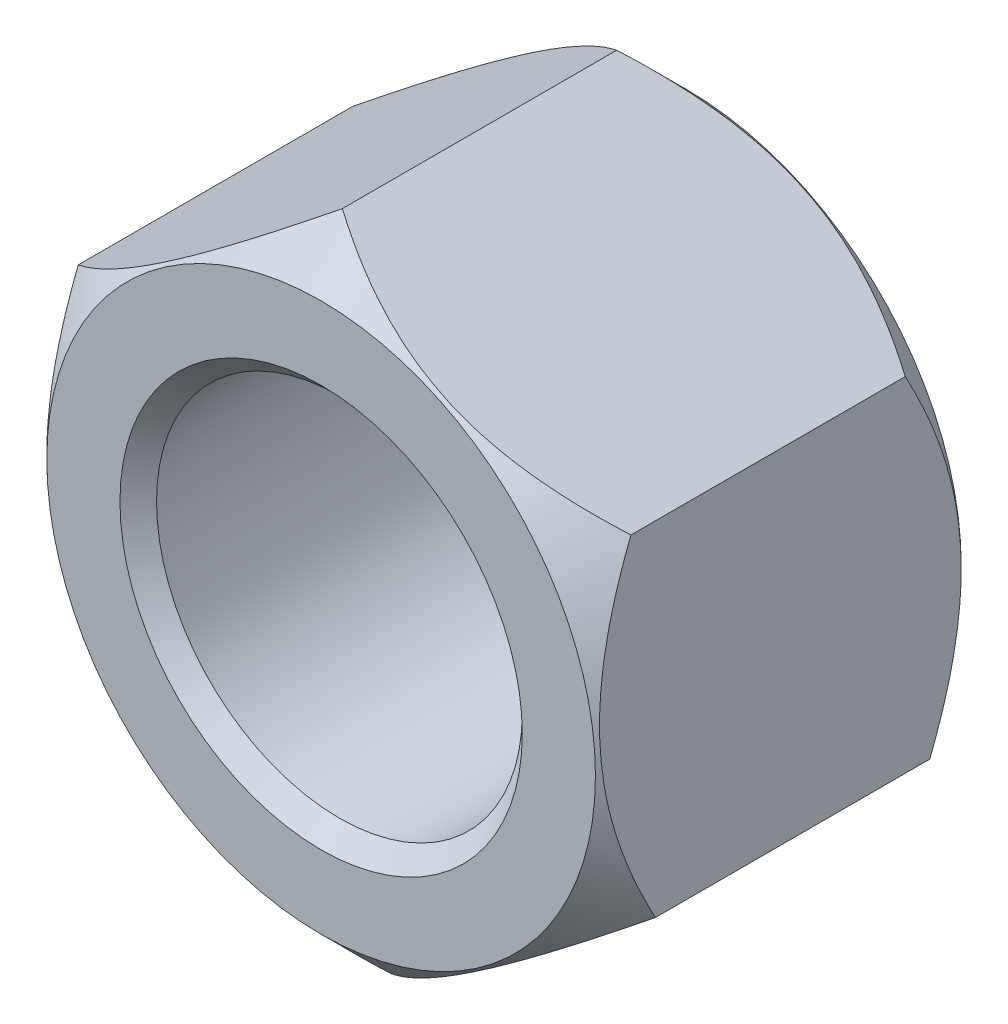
ISO-10303-21;
HEADER;
FILE_DESCRIPTION(('STEP AP214'),'2;1');
FILE_NAME('part.step','',(''),(''),'','','');
FILE_SCHEMA(('AUTOMOTIVE_DESIGN { 1 0 10303 214 1 1 1 1 }'));
ENDSEC;
DATA;
#1=APPLICATION_CONTEXT('core data for automotive mechanical design processes');
#2=APPLICATION_PROTOCOL_DEFINITION('international standard','automotive_design',2000,#1);
#3=PRODUCT_CONTEXT('',#1,'mechanical');
#4=PRODUCT('Part','Part','',(#3));
#5=PRODUCT_RELATED_PRODUCT_CATEGORY('part','',(#4));
#6=PRODUCT_DEFINITION_FORMATION('','',#4);
#7=PRODUCT_DEFINITION_CONTEXT('part definition',#1,'design');
#8=PRODUCT_DEFINITION('design','',#6,#7);
#9=PRODUCT_DEFINITION_SHAPE('','',#8);
#10=(LENGTH_UNIT() NAMED_UNIT(*) SI_UNIT(.MILLI.,.METRE.));
#11=(NAMED_UNIT(*) PLANE_ANGLE_UNIT() SI_UNIT($,.RADIAN.));
#12=(NAMED_UNIT(*) SI_UNIT($,.STERADIAN.) SOLID_ANGLE_UNIT());
#13=UNCERTAINTY_MEASURE_WITH_UNIT(LENGTH_MEASURE(1.E-05),#10,'distance_accuracy_value','');
#14=(GEOMETRIC_REPRESENTATION_CONTEXT(3) GLOBAL_UNCERTAINTY_ASSIGNED_CONTEXT((#13)) GLOBAL_UNIT_ASSIGNED_CONTEXT((#10,
#11,#12)) REPRESENTATION_CONTEXT('',''));
#15=CARTESIAN_POINT('',(0.,0.,0.));
#16=DIRECTION('',(0.,0.,1.));
#17=DIRECTION('',(1.,0.,0.));
#18=AXIS2_PLACEMENT_3D('',#15,#16,#17);
#19=CARTESIAN_POINT('',(0.,0.,4.));
#20=DIRECTION('',(0.,0.,1.));
#21=DIRECTION('',(1.,0.,0.));
#22=AXIS2_PLACEMENT_3D('',#19,#20,#21);
#23=PLANE('',#22);
#24=CARTESIAN_POINT('',(0.,0.,4.));
#25=DIRECTION('',(0.,0.,1.));
#26=DIRECTION('',(1.,0.,0.));
#27=AXIS2_PLACEMENT_3D('',#24,#25,#26);
#28=CIRCLE('',#27,2.2);
#29=CARTESIAN_POINT('',(2.2,0.,4.));
#30=VERTEX_POINT('',#29);
#31=EDGE_CURVE('E11',#30,#30,#28,.F.);
#32=ORIENTED_EDGE('',*,*,#31,.T.);
#33=EDGE_LOOP('',(#32));
#34=FACE_BOUND('',#33,.T.);
#35=CARTESIAN_POINT('',(0.,0.,4.));
#36=DIRECTION('',(0.,0.,1.));
#37=DIRECTION('',(1.,0.,0.));
#38=AXIS2_PLACEMENT_3D('',#35,#36,#37);
#39=CIRCLE('',#38,3.);
#40=CARTESIAN_POINT('',(3.,0.,4.));
#41=VERTEX_POINT('',#40);
#42=EDGE_CURVE('E115',#41,#41,#39,.T.);
#43=ORIENTED_EDGE('',*,*,#42,.T.);
#44=EDGE_LOOP('',(#43));
#45=FACE_BOUND('',#44,.T.);
#46=ADVANCED_FACE('F35',(#34,#45),#23,.T.);
#47=CARTESIAN_POINT('',(0.,0.,0.));
#48=DIRECTION('',(0.,0.,1.));
#49=DIRECTION('',(1.,0.,0.));
#50=AXIS2_PLACEMENT_3D('',#47,#48,#49);
#51=PLANE('',#50);
#52=CARTESIAN_POINT('',(0.,0.,0.));
#53=DIRECTION('',(0.,0.,1.));
#54=DIRECTION('',(1.,0.,0.));
#55=AXIS2_PLACEMENT_3D('',#52,#53,#54);
#56=CIRCLE('',#55,2.2);
#57=CARTESIAN_POINT('',(-2.2,0.,0.));
#58=VERTEX_POINT('',#57);
#59=EDGE_CURVE('E143',#58,#58,#56,.T.);
#60=ORIENTED_EDGE('',*,*,#59,.T.);
#61=EDGE_LOOP('',(#60));
#62=FACE_BOUND('',#61,.T.);
#63=CARTESIAN_POINT('',(0.,0.,0.));
#64=DIRECTION('',(0.,0.,1.));
#65=DIRECTION('',(1.,0.,0.));
#66=AXIS2_PLACEMENT_3D('',#63,#64,#65);
#67=CIRCLE('',#66,3.);
#68=CARTESIAN_POINT('',(3.,0.,0.));
#69=VERTEX_POINT('',#68);
#70=EDGE_CURVE('E112',#69,#69,#67,.F.);
#71=ORIENTED_EDGE('',*,*,#70,.T.);
#72=EDGE_LOOP('',(#71));
#73=FACE_BOUND('',#72,.T.);
#74=ADVANCED_FACE('F236',(#62,#73),#51,.F.);
#75=CARTESIAN_POINT('',(0.,0.,4.));
#76=DIRECTION('',(0.,0.,-1.));
#77=DIRECTION('',(-1.,0.,0.));
#78=AXIS2_PLACEMENT_3D('',#75,#76,#77);
#79=CYLINDRICAL_SURFACE('',#78,2.);
#80=CARTESIAN_POINT('',(0.,0.,0.2));
#81=DIRECTION('',(0.,0.,1.));
#82=DIRECTION('',(1.,0.,0.));
#83=AXIS2_PLACEMENT_3D('',#80,#81,#82);
#84=CIRCLE('',#83,2.);
#85=CARTESIAN_POINT('',(-2.,0.,0.2));
#86=VERTEX_POINT('',#85);
#87=EDGE_CURVE('E43',#86,#86,#84,.F.);
#88=ORIENTED_EDGE('',*,*,#87,.T.);
#89=EDGE_LOOP('',(#88));
#90=FACE_BOUND('',#89,.T.);
#91=CARTESIAN_POINT('',(0.,0.,3.8));
#92=DIRECTION('',(0.,0.,1.));
#93=DIRECTION('',(1.,0.,0.));
#94=AXIS2_PLACEMENT_3D('',#91,#92,#93);
#95=CIRCLE('',#94,2.);
#96=CARTESIAN_POINT('',(2.,0.,3.8));
#97=VERTEX_POINT('',#96);
#98=EDGE_CURVE('E248',#97,#97,#95,.T.);
#99=ORIENTED_EDGE('',*,*,#98,.T.);
#100=EDGE_LOOP('',(#99));
#101=FACE_BOUND('',#100,.T.);
#102=ADVANCED_FACE('F135',(#90,#101),#79,.F.);
#103=CARTESIAN_POINT('',(0.,0.,0.499999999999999));
#104=DIRECTION('',(0.,0.,1.));
#105=DIRECTION('',(1.,0.,0.));
#106=AXIS2_PLACEMENT_3D('',#103,#104,#105);
#107=CONICAL_SURFACE('',#106,3.5,0.78539816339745);
#108=CARTESIAN_POINT('',(2.88854722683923,1.97663128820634,0.500110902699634));
#109=CARTESIAN_POINT('',(2.78005952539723,2.02864024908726,0.440007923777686));
#110=CARTESIAN_POINT('',(2.66975777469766,2.08151886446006,0.383434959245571));
#111=CARTESIAN_POINT('',(2.44484047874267,2.18934412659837,0.279851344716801));
#112=CARTESIAN_POINT('',(2.33020354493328,2.24430102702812,0.232898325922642));
#113=CARTESIAN_POINT('',(2.09904368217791,2.35511897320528,0.152466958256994));
#114=CARTESIAN_POINT('',(1.98257961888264,2.41095179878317,0.118786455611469));
#115=CARTESIAN_POINT('',(1.74708757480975,2.52384659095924,0.0668947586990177));
#116=CARTESIAN_POINT('',(1.62806678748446,2.58090510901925,0.0486448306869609));
#117=CARTESIAN_POINT('',(1.42293919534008,2.67924319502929,0.0321785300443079));
#118=CARTESIAN_POINT('',(1.33709729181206,2.72039576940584,0.0297410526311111));
#119=CARTESIAN_POINT('',(1.16555311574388,2.80263397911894,0.0338483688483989));
#120=CARTESIAN_POINT('',(1.07985090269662,2.84371958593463,0.040396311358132));
#121=CARTESIAN_POINT('',(0.909258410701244,2.92550155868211,0.0621005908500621));
#122=CARTESIAN_POINT('',(0.824369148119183,2.96619743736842,0.077266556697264));
#123=CARTESIAN_POINT('',(0.656048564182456,3.04689025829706,0.115379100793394));
#124=CARTESIAN_POINT('',(0.572617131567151,3.08688725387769,0.138325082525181));
#125=CARTESIAN_POINT('',(0.424502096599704,3.15789354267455,0.185535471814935));
#126=CARTESIAN_POINT('',(0.359490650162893,3.18906000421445,0.208558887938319));
#127=CARTESIAN_POINT('',(0.230634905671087,3.25083339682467,0.25831633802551));
#128=CARTESIAN_POINT('',(0.166790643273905,3.28144031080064,0.285050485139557));
#129=CARTESIAN_POINT('',(0.0404704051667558,3.34199818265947,0.341630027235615));
#130=CARTESIAN_POINT('',(-0.0220091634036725,3.3719508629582,0.371465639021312));
#131=CARTESIAN_POINT('',(-0.145811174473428,3.43130149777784,0.433856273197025));
#132=CARTESIAN_POINT('',(-0.207134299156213,3.46069977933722,0.46640962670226));
#133=CARTESIAN_POINT('',(-0.267922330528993,3.48984153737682,0.500110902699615));
#134=B_SPLINE_CURVE_WITH_KNOTS('',3,(#108,#109,#110,#111,#112,#113,#114,#115,#116,#117,#118,
#119,#120,#121,#122,#123,#124,#125,#126,#127,#128,#129,#130,#131,#132,#133),.UNSPECIFIED.,.F.,
.F.,(4,2,2,2,2,2,2,2,2,2,2,2,4),(0.,0.403741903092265,0.809836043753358,1.20948085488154,
1.60811947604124,1.8933986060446,2.17877773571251,2.46447634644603,2.75015305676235,
2.97709555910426,3.20404498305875,3.43029907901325,3.65641524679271),.UNSPECIFIED.);
#135=CARTESIAN_POINT('',(2.88834722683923,1.97672716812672,0.500000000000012));
#136=VERTEX_POINT('',#135);
#137=CARTESIAN_POINT('',(-0.267722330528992,3.48974565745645,0.499999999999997));
#138=VERTEX_POINT('',#137);
#139=EDGE_CURVE('E87',#136,#138,#134,.T.);
#140=ORIENTED_EDGE('',*,*,#139,.F.);
#141=CARTESIAN_POINT('',(3.15608490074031,-1.51321848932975,0.50010029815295));
#142=CARTESIAN_POINT('',(3.14688222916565,-1.39326217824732,0.439998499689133));
#143=CARTESIAN_POINT('',(3.13752567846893,-1.27130006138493,0.383426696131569));
#144=CARTESIAN_POINT('',(3.11844665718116,-1.02260608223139,0.279845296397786));
#145=CARTESIAN_POINT('',(3.10872237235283,-0.895850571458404,0.232893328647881));
#146=CARTESIAN_POINT('',(3.08911382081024,-0.640254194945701,0.152463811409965));
#147=CARTESIAN_POINT('',(3.07923454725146,-0.511478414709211,0.118784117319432));
#148=CARTESIAN_POINT('',(3.05925851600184,-0.251091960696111,0.0668937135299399));
#149=CARTESIAN_POINT('',(3.04916236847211,-0.119489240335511,0.0486442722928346));
#150=CARTESIAN_POINT('',(3.03176197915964,0.107323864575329,0.0321783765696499));
#151=CARTESIAN_POINT('',(3.02448020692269,0.202241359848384,0.0297410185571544));
#152=CARTESIAN_POINT('',(3.00992850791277,0.391921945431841,0.0338485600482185));
#153=CARTESIAN_POINT('',(3.00265858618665,0.486684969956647,0.040396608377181));
#154=CARTESIAN_POINT('',(2.98818761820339,0.675313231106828,0.0621010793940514));
#155=CARTESIAN_POINT('',(2.9809866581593,0.769177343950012,0.077267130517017));
#156=CARTESIAN_POINT('',(2.96670841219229,0.955293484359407,0.115379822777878));
#157=CARTESIAN_POINT('',(2.95963111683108,1.04754563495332,0.138325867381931));
#158=CARTESIAN_POINT('',(2.94706702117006,1.21131792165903,0.185535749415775));
#159=CARTESIAN_POINT('',(2.9415524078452,1.28320059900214,0.208558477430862));
#160=CARTESIAN_POINT('',(2.93062218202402,1.42567548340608,0.258314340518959));
#161=CARTESIAN_POINT('',(2.92520657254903,1.4962676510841,0.2850475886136));
#162=CARTESIAN_POINT('',(2.91449141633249,1.63593911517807,0.341625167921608));
#163=CARTESIAN_POINT('',(2.90919156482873,1.70502238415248,0.371459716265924));
#164=CARTESIAN_POINT('',(2.89869001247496,1.84190953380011,0.43384809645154));
#165=CARTESIAN_POINT('',(2.89348825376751,1.90971416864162,0.466400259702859));
#166=CARTESIAN_POINT('',(2.88833188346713,1.9769271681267,0.500100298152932));
#167=B_SPLINE_CURVE_WITH_KNOTS('',3,(#141,#142,#143,#144,#145,#146,#147,#148,#149,#150,#151,
#152,#153,#154,#155,#156,#157,#158,#159,#160,#161,#162,#163,#164,#165,#166),.UNSPECIFIED.,.F.,
.F.,(4,2,2,2,2,2,2,2,2,2,2,2,4),(0.,0.403736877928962,0.809825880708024,1.20946581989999,
1.60809961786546,1.89337855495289,2.17875749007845,2.46445589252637,2.75013239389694,
2.97706820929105,3.20401093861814,3.43025834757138,3.6563678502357),.UNSPECIFIED.);
#168=CARTESIAN_POINT('',(3.15606955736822,-1.51301848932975,0.500000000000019));
#169=VERTEX_POINT('',#168);
#170=EDGE_CURVE('E184',#169,#136,#167,.T.);
#171=ORIENTED_EDGE('',*,*,#170,.F.);
#172=CARTESIAN_POINT('',(0.267522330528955,-3.48988253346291,0.500121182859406));
#173=CARTESIAN_POINT('',(0.366808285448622,-3.42193320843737,0.440017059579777));
#174=CARTESIAN_POINT('',(0.467754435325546,-3.35284767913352,0.383442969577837));
#175=CARTESIAN_POINT('',(0.673594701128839,-3.21197471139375,0.279857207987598));
#176=CARTESIAN_POINT('',(0.778508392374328,-3.1401738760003,0.232903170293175));
#177=CARTESIAN_POINT('',(0.990061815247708,-2.9953909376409,0.152470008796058));
#178=CARTESIAN_POINT('',(1.09664767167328,-2.92244570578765,0.118788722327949));
#179=CARTESIAN_POINT('',(1.31216588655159,-2.77494934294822,0.0668957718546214));
#180=CARTESIAN_POINT('',(1.42109166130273,-2.70040271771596,0.0486453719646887));
#181=CARTESIAN_POINT('',(1.60882005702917,-2.5719251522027,0.0321786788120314));
#182=CARTESIAN_POINT('',(1.68738023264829,-2.51816013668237,0.0297410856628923));
#183=CARTESIAN_POINT('',(1.84437280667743,-2.41071755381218,0.03384818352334));
#184=CARTESIAN_POINT('',(1.92280515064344,-2.35704002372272,0.0403960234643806));
#185=CARTESIAN_POINT('',(2.07892678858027,-2.25019349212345,0.0621001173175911));
#186=CARTESIAN_POINT('',(2.15661515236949,-2.19702512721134,0.0772660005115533));
#187=CARTESIAN_POINT('',(2.31065761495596,-2.09160154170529,0.115378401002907));
#188=CARTESIAN_POINT('',(2.38701181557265,-2.03934625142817,0.138324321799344));
#189=CARTESIAN_POINT('',(2.52256438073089,-1.94657678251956,0.185535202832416));
#190=CARTESIAN_POINT('',(2.58206275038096,-1.90585728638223,0.208559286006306));
#191=CARTESIAN_POINT('',(2.69999128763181,-1.82514935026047,0.258318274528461));
#192=CARTESIAN_POINT('',(2.75842142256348,-1.78516093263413,0.285053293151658));
#193=CARTESIAN_POINT('',(2.87402941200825,-1.70604113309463,0.34163473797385));
#194=CARTESIAN_POINT('',(2.93121055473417,-1.66690750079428,0.371471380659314));
#195=CARTESIAN_POINT('',(3.0445138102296,-1.58936501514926,0.433864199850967));
#196=CARTESIAN_POINT('',(3.10063654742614,-1.5509557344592,0.466418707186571));
#197=CARTESIAN_POINT('',(3.15626955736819,-1.51288161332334,0.500121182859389));
#198=B_SPLINE_CURVE_WITH_KNOTS('',3,(#172,#173,#174,#175,#176,#177,#178,#179,#180,#181,#182,
#183,#184,#185,#186,#187,#188,#189,#190,#191,#192,#193,#194,#195,#196,#197),.UNSPECIFIED.,.F.,
.F.,(4,2,2,2,2,2,2,2,2,2,2,2,4),(0.,0.403746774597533,0.809845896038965,1.20949543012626,
1.60813872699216,1.89341804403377,2.1787973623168,2.46449617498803,2.75017308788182,
2.97712207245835,3.20407798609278,3.4303385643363,3.65646119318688),.UNSPECIFIED.);
#199=CARTESIAN_POINT('',(0.267722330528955,-3.48974565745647,0.500000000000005));
#200=VERTEX_POINT('',#199);
#201=EDGE_CURVE('E202',#200,#169,#198,.T.);
#202=ORIENTED_EDGE('',*,*,#201,.F.);
#203=CARTESIAN_POINT('',(-2.88854722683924,-1.97663128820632,0.500110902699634));
#204=CARTESIAN_POINT('',(-2.78005952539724,-2.02864024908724,0.440007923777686));
#205=CARTESIAN_POINT('',(-2.66975777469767,-2.08151886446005,0.383434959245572));
#206=CARTESIAN_POINT('',(-2.44484047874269,-2.18934412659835,0.279851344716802));
#207=CARTESIAN_POINT('',(-2.3302035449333,-2.24430102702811,0.232898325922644));
#208=CARTESIAN_POINT('',(-2.09904368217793,-2.35511897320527,0.152466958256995));
#209=CARTESIAN_POINT('',(-1.98257961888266,-2.41095179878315,0.11878645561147));
#210=CARTESIAN_POINT('',(-1.74708757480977,-2.52384659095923,0.0668947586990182));
#211=CARTESIAN_POINT('',(-1.62806678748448,-2.58090510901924,0.0486448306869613));
#212=CARTESIAN_POINT('',(-1.4229391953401,-2.67924319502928,0.0321785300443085));
#213=CARTESIAN_POINT('',(-1.33709729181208,-2.72039576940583,0.0297410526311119));
#214=CARTESIAN_POINT('',(-1.1655531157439,-2.80263397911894,0.0338483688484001));
#215=CARTESIAN_POINT('',(-1.07985090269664,-2.84371958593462,0.0403963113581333));
#216=CARTESIAN_POINT('',(-0.909258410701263,-2.9255015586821,0.0621005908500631));
#217=CARTESIAN_POINT('',(-0.824369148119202,-2.96619743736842,0.0772665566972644));
#218=CARTESIAN_POINT('',(-0.656048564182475,-3.04689025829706,0.115379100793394));
#219=CARTESIAN_POINT('',(-0.572617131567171,-3.08688725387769,0.138325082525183));
#220=CARTESIAN_POINT('',(-0.424502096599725,-3.15789354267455,0.185535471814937));
#221=CARTESIAN_POINT('',(-0.359490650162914,-3.18906000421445,0.20855888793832));
#222=CARTESIAN_POINT('',(-0.230634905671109,-3.25083339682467,0.258316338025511));
#223=CARTESIAN_POINT('',(-0.166790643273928,-3.28144031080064,0.285050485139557));
#224=CARTESIAN_POINT('',(-0.040470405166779,-3.34199818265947,0.341630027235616));
#225=CARTESIAN_POINT('',(0.0220091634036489,-3.3719508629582,0.371465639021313));
#226=CARTESIAN_POINT('',(0.145811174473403,-3.43130149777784,0.433856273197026));
#227=CARTESIAN_POINT('',(0.207134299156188,-3.46069977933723,0.466409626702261));
#228=CARTESIAN_POINT('',(0.267922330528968,-3.48984153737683,0.500110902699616));
#229=B_SPLINE_CURVE_WITH_KNOTS('',3,(#203,#204,#205,#206,#207,#208,#209,#210,#211,#212,#213,
#214,#215,#216,#217,#218,#219,#220,#221,#222,#223,#224,#225,#226,#227,#228),.UNSPECIFIED.,.F.,
.F.,(4,2,2,2,2,2,2,2,2,2,2,2,4),(0.,0.403741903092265,0.809836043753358,1.20948085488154,
1.60811947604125,1.8933986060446,2.17877773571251,2.46447634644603,2.75015305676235,
2.97709555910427,3.20404498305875,3.43029907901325,3.65641524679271),.UNSPECIFIED.);
#230=CARTESIAN_POINT('',(-2.88834722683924,-1.9767271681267,0.500000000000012));
#231=VERTEX_POINT('',#230);
#232=EDGE_CURVE('E212',#231,#200,#229,.T.);
#233=ORIENTED_EDGE('',*,*,#232,.F.);
#234=CARTESIAN_POINT('',(-3.1560849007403,1.51321848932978,0.50010029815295));
#235=CARTESIAN_POINT('',(-3.14688222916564,1.39326217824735,0.439998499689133));
#236=CARTESIAN_POINT('',(-3.13752567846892,1.27130006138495,0.383426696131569));
#237=CARTESIAN_POINT('',(-3.11844665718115,1.02260608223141,0.279845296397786));
#238=CARTESIAN_POINT('',(-3.10872237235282,0.895850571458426,0.232893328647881));
#239=CARTESIAN_POINT('',(-3.08911382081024,0.640254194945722,0.152463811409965));
#240=CARTESIAN_POINT('',(-3.07923454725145,0.511478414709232,0.118784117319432));
#241=CARTESIAN_POINT('',(-3.05925851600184,0.251091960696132,0.0668937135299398));
#242=CARTESIAN_POINT('',(-3.04916236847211,0.119489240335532,0.0486442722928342));
#243=CARTESIAN_POINT('',(-3.03176197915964,-0.107323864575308,0.0321783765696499));
#244=CARTESIAN_POINT('',(-3.02448020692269,-0.202241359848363,0.0297410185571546));
#245=CARTESIAN_POINT('',(-3.00992850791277,-0.39192194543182,0.033848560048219));
#246=CARTESIAN_POINT('',(-3.00265858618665,-0.486684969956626,0.0403966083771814));
#247=CARTESIAN_POINT('',(-2.9881876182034,-0.675313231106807,0.0621010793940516));
#248=CARTESIAN_POINT('',(-2.9809866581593,-0.769177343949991,0.0772671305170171));
#249=CARTESIAN_POINT('',(-2.96670841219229,-0.955293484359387,0.115379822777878));
#250=CARTESIAN_POINT('',(-2.95963111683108,-1.0475456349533,0.138325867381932));
#251=CARTESIAN_POINT('',(-2.94706702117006,-1.211317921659,0.185535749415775));
#252=CARTESIAN_POINT('',(-2.94155240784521,-1.28320059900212,0.208558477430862));
#253=CARTESIAN_POINT('',(-2.93062218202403,-1.42567548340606,0.258314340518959));
#254=CARTESIAN_POINT('',(-2.92520657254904,-1.49626765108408,0.2850475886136));
#255=CARTESIAN_POINT('',(-2.9144914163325,-1.63593911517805,0.341625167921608));
#256=CARTESIAN_POINT('',(-2.90919156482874,-1.70502238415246,0.371459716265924));
#257=CARTESIAN_POINT('',(-2.89869001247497,-1.84190953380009,0.43384809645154));
#258=CARTESIAN_POINT('',(-2.89348825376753,-1.9097141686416,0.466400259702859));
#259=CARTESIAN_POINT('',(-2.88833188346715,-1.97692716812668,0.500100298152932));
#260=B_SPLINE_CURVE_WITH_KNOTS('',3,(#234,#235,#236,#237,#238,#239,#240,#241,#242,#243,#244,
#245,#246,#247,#248,#249,#250,#251,#252,#253,#254,#255,#256,#257,#258,#259),.UNSPECIFIED.,.F.,
.F.,(4,2,2,2,2,2,2,2,2,2,2,2,4),(0.,0.403736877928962,0.809825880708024,1.20946581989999,
1.60809961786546,1.89337855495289,2.17875749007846,2.46445589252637,2.75013239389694,
2.97706820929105,3.20401093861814,3.43025834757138,3.6563678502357),.UNSPECIFIED.);
#261=CARTESIAN_POINT('',(-3.15606955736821,1.51301848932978,0.500000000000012));
#262=VERTEX_POINT('',#261);
#263=EDGE_CURVE('E111',#262,#231,#260,.T.);
#264=ORIENTED_EDGE('',*,*,#263,.F.);
#265=CARTESIAN_POINT('',(-0.267522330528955,3.48988253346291,0.500121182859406));
#266=CARTESIAN_POINT('',(-0.366808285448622,3.42193320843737,0.440017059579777));
#267=CARTESIAN_POINT('',(-0.467754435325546,3.35284767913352,0.383442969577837));
#268=CARTESIAN_POINT('',(-0.673594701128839,3.21197471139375,0.279857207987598));
#269=CARTESIAN_POINT('',(-0.778508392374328,3.1401738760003,0.232903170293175));
#270=CARTESIAN_POINT('',(-0.990061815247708,2.9953909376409,0.152470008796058));
#271=CARTESIAN_POINT('',(-1.09664767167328,2.92244570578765,0.118788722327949));
#272=CARTESIAN_POINT('',(-1.31216588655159,2.77494934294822,0.0668957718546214));
#273=CARTESIAN_POINT('',(-1.42109166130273,2.70040271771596,0.0486453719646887));
#274=CARTESIAN_POINT('',(-1.60882005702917,2.5719251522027,0.0321786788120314));
#275=CARTESIAN_POINT('',(-1.68738023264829,2.51816013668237,0.0297410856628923));
#276=CARTESIAN_POINT('',(-1.84437280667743,2.41071755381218,0.03384818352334));
#277=CARTESIAN_POINT('',(-1.92280515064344,2.35704002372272,0.0403960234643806));
#278=CARTESIAN_POINT('',(-2.07892678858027,2.25019349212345,0.0621001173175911));
#279=CARTESIAN_POINT('',(-2.15661515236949,2.19702512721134,0.0772660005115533));
#280=CARTESIAN_POINT('',(-2.31065761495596,2.09160154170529,0.115378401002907));
#281=CARTESIAN_POINT('',(-2.38701181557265,2.03934625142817,0.138324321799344));
#282=CARTESIAN_POINT('',(-2.52256438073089,1.94657678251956,0.185535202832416));
#283=CARTESIAN_POINT('',(-2.58206275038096,1.90585728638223,0.208559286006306));
#284=CARTESIAN_POINT('',(-2.69999128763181,1.82514935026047,0.258318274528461));
#285=CARTESIAN_POINT('',(-2.75842142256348,1.78516093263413,0.285053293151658));
#286=CARTESIAN_POINT('',(-2.87402941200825,1.70604113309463,0.34163473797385));
#287=CARTESIAN_POINT('',(-2.93121055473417,1.66690750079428,0.371471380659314));
#288=CARTESIAN_POINT('',(-3.0445138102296,1.58936501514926,0.433864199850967));
#289=CARTESIAN_POINT('',(-3.10063654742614,1.5509557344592,0.466418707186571));
#290=CARTESIAN_POINT('',(-3.15626955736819,1.51288161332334,0.500121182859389));
#291=B_SPLINE_CURVE_WITH_KNOTS('',3,(#265,#266,#267,#268,#269,#270,#271,#272,#273,#274,#275,
#276,#277,#278,#279,#280,#281,#282,#283,#284,#285,#286,#287,#288,#289,#290),.UNSPECIFIED.,.F.,
.F.,(4,2,2,2,2,2,2,2,2,2,2,2,4),(0.,0.403746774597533,0.809845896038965,1.20949543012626,
1.60813872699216,1.89341804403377,2.1787973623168,2.46449617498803,2.75017308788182,
2.97712207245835,3.20407798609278,3.4303385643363,3.65646119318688),.UNSPECIFIED.);
#292=EDGE_CURVE('E104',#138,#262,#291,.T.);
#293=ORIENTED_EDGE('',*,*,#292,.F.);
#294=EDGE_LOOP('',(#140,#171,#202,#233,#264,#293));
#295=FACE_BOUND('',#294,.T.);
#296=ORIENTED_EDGE('',*,*,#70,.F.);
#297=EDGE_LOOP('',(#296));
#298=FACE_BOUND('',#297,.T.);
#299=ADVANCED_FACE('F108',(#295,#298),#107,.T.);
#300=CARTESIAN_POINT('',(0.,0.,4.));
#301=DIRECTION('',(0.,0.,-1.));
#302=DIRECTION('',(-1.,0.,0.));
#303=AXIS2_PLACEMENT_3D('',#300,#301,#302);
#304=CONICAL_SURFACE('',#303,3.,0.785398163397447);
#305=CARTESIAN_POINT('',(-0.267922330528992,3.48984153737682,3.49988909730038));
#306=CARTESIAN_POINT('',(-0.159434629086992,3.4378325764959,3.55999207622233));
#307=CARTESIAN_POINT('',(-0.0491328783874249,3.3849539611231,3.61656504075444));
#308=CARTESIAN_POINT('',(0.175784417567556,3.2771286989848,3.72014865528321));
#309=CARTESIAN_POINT('',(0.290421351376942,3.22217179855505,3.76710167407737));
#310=CARTESIAN_POINT('',(0.521581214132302,3.11135385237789,3.84753304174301));
#311=CARTESIAN_POINT('',(0.638045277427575,3.05552102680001,3.88121354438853));
#312=CARTESIAN_POINT('',(0.873537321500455,2.94262623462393,3.93310524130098));
#313=CARTESIAN_POINT('',(0.992558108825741,2.88556771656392,3.95135516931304));
#314=CARTESIAN_POINT('',(1.19768570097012,2.78722963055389,3.96782146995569));
#315=CARTESIAN_POINT('',(1.28352760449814,2.74607705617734,3.97025894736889));
#316=CARTESIAN_POINT('',(1.45507178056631,2.66383884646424,3.9661516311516));
#317=CARTESIAN_POINT('',(1.54077399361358,2.62275323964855,3.95960368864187));
#318=CARTESIAN_POINT('',(1.71136648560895,2.54097126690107,3.93789940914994));
#319=CARTESIAN_POINT('',(1.79625574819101,2.50027538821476,3.92273344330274));
#320=CARTESIAN_POINT('',(1.96457633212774,2.41958256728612,3.88462089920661));
#321=CARTESIAN_POINT('',(2.04800776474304,2.37958557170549,3.86167491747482));
#322=CARTESIAN_POINT('',(2.19612279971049,2.30857928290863,3.81446452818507));
#323=CARTESIAN_POINT('',(2.26113424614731,2.27741282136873,3.79144111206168));
#324=CARTESIAN_POINT('',(2.38998999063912,2.21563942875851,3.74168366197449));
#325=CARTESIAN_POINT('',(2.45383425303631,2.18503251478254,3.71494951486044));
#326=CARTESIAN_POINT('',(2.58015449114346,2.12447464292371,3.65836997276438));
#327=CARTESIAN_POINT('',(2.6426340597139,2.09452196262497,3.62853436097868));
#328=CARTESIAN_POINT('',(2.76643607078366,2.03517132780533,3.56614372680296));
#329=CARTESIAN_POINT('',(2.82775919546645,2.00577304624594,3.53359037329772));
#330=CARTESIAN_POINT('',(2.88854722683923,1.97663128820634,3.49988909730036));
#331=B_SPLINE_CURVE_WITH_KNOTS('',3,(#305,#306,#307,#308,#309,#310,#311,#312,#313,#314,#315,
#316,#317,#318,#319,#320,#321,#322,#323,#324,#325,#326,#327,#328,#329,#330),.UNSPECIFIED.,.F.,
.F.,(4,2,2,2,2,2,2,2,2,2,2,2,4),(0.,0.403741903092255,0.809836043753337,1.20948085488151,
1.6081194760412,1.89339860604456,2.17877773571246,2.46447634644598,2.75015305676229,
2.97709555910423,3.20404498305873,3.43029907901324,3.65641524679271),.UNSPECIFIED.);
#332=CARTESIAN_POINT('',(-0.267722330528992,3.48974565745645,3.5));
#333=VERTEX_POINT('',#332);
#334=CARTESIAN_POINT('',(2.88834722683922,1.9767271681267,3.5));
#335=VERTEX_POINT('',#334);
#336=EDGE_CURVE('E98',#333,#335,#331,.T.);
#337=ORIENTED_EDGE('',*,*,#336,.F.);
#338=CARTESIAN_POINT('',(-3.15626955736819,1.51288161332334,3.49987881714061));
#339=CARTESIAN_POINT('',(-3.05698360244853,1.58083093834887,3.55998294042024));
#340=CARTESIAN_POINT('',(-2.9560374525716,1.64991646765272,3.61655703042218));
#341=CARTESIAN_POINT('',(-2.75019718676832,1.79078943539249,3.72014279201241));
#342=CARTESIAN_POINT('',(-2.64528349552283,1.86259027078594,3.76709682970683));
#343=CARTESIAN_POINT('',(-2.43373007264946,2.00737320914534,3.84752999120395));
#344=CARTESIAN_POINT('',(-2.32714421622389,2.08031844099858,3.88121127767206));
#345=CARTESIAN_POINT('',(-2.11162600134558,2.22781480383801,3.93310422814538));
#346=CARTESIAN_POINT('',(-2.00270022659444,2.30236142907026,3.95135462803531));
#347=CARTESIAN_POINT('',(-1.81497183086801,2.43083899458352,3.96782132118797));
#348=CARTESIAN_POINT('',(-1.73641165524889,2.48460401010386,3.97025891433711));
#349=CARTESIAN_POINT('',(-1.57941908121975,2.59204659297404,3.96615181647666));
#350=CARTESIAN_POINT('',(-1.50098673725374,2.6457241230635,3.95960397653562));
#351=CARTESIAN_POINT('',(-1.34486509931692,2.75257065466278,3.93789988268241));
#352=CARTESIAN_POINT('',(-1.2671767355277,2.80573901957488,3.92273399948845));
#353=CARTESIAN_POINT('',(-1.11313427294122,2.91116260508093,3.8846215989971));
#354=CARTESIAN_POINT('',(-1.03678007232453,2.96341789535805,3.86167567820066));
#355=CARTESIAN_POINT('',(-0.901227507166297,3.05618736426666,3.81446479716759));
#356=CARTESIAN_POINT('',(-0.841729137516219,3.09690686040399,3.7914407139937));
#357=CARTESIAN_POINT('',(-0.723800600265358,3.17761479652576,3.74168172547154));
#358=CARTESIAN_POINT('',(-0.665370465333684,3.2176032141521,3.71494670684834));
#359=CARTESIAN_POINT('',(-0.549762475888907,3.29672301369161,3.65836526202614));
#360=CARTESIAN_POINT('',(-0.492581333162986,3.33585664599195,3.62852861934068));
#361=CARTESIAN_POINT('',(-0.379278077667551,3.41339913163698,3.56613580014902));
#362=CARTESIAN_POINT('',(-0.323155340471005,3.45180841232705,3.53358129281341));
#363=CARTESIAN_POINT('',(-0.267522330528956,3.48988253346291,3.49987881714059));
#364=B_SPLINE_CURVE_WITH_KNOTS('',3,(#338,#339,#340,#341,#342,#343,#344,#345,#346,#347,#348,
#349,#350,#351,#352,#353,#354,#355,#356,#357,#358,#359,#360,#361,#362,#363),.UNSPECIFIED.,.F.,
.F.,(4,2,2,2,2,2,2,2,2,2,2,2,4),(0.,0.403746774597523,0.809845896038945,1.20949543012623,
1.60813872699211,1.89341804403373,2.17879736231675,2.46449617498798,2.75017308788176,
2.97712207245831,3.20407798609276,3.43033856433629,3.65646119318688),.UNSPECIFIED.);
#365=CARTESIAN_POINT('',(-3.15606955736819,1.51301848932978,3.5));
#366=VERTEX_POINT('',#365);
#367=EDGE_CURVE('E106',#366,#333,#364,.T.);
#368=ORIENTED_EDGE('',*,*,#367,.F.);
#369=CARTESIAN_POINT('',(-2.88833188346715,-1.97692716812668,3.49989970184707));
#370=CARTESIAN_POINT('',(-2.8975345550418,-1.85697085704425,3.56000150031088));
#371=CARTESIAN_POINT('',(-2.90689110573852,-1.73500874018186,3.61657330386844));
#372=CARTESIAN_POINT('',(-2.92597012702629,-1.48631476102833,3.72015470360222));
#373=CARTESIAN_POINT('',(-2.93569441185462,-1.35955925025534,3.76710667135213));
#374=CARTESIAN_POINT('',(-2.9553029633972,-1.10396287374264,3.84753618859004));
#375=CARTESIAN_POINT('',(-2.96518223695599,-0.975187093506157,3.88121588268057));
#376=CARTESIAN_POINT('',(-2.98515826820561,-0.714800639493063,3.93310628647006));
#377=CARTESIAN_POINT('',(-2.99525441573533,-0.583197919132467,3.95135572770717));
#378=CARTESIAN_POINT('',(-3.0126548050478,-0.356384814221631,3.96782162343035));
#379=CARTESIAN_POINT('',(-3.01993657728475,-0.261467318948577,3.97025898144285));
#380=CARTESIAN_POINT('',(-3.03448827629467,-0.0717867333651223,3.96615143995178));
#381=CARTESIAN_POINT('',(-3.04175819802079,0.022976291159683,3.95960339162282));
#382=CARTESIAN_POINT('',(-3.05622916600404,0.211604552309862,3.93789892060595));
#383=CARTESIAN_POINT('',(-3.06343012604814,0.305468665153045,3.92273286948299));
#384=CARTESIAN_POINT('',(-3.07770837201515,0.491584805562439,3.88462017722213));
#385=CARTESIAN_POINT('',(-3.08478566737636,0.583836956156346,3.86167413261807));
#386=CARTESIAN_POINT('',(-3.09734976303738,0.74760924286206,3.81446425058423));
#387=CARTESIAN_POINT('',(-3.10286437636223,0.819491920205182,3.79144152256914));
#388=CARTESIAN_POINT('',(-3.11379460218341,0.961966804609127,3.74168565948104));
#389=CARTESIAN_POINT('',(-3.11921021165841,1.03255897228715,3.7149524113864));
#390=CARTESIAN_POINT('',(-3.12992536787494,1.17223043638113,3.65837483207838));
#391=CARTESIAN_POINT('',(-3.1352252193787,1.24131370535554,3.62854028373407));
#392=CARTESIAN_POINT('',(-3.14572677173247,1.37820085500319,3.56615190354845));
#393=CARTESIAN_POINT('',(-3.15092853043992,1.44600548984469,3.53359974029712));
#394=CARTESIAN_POINT('',(-3.1560849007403,1.51321848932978,3.49989970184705));
#395=B_SPLINE_CURVE_WITH_KNOTS('',3,(#369,#370,#371,#372,#373,#374,#375,#376,#377,#378,#379,
#380,#381,#382,#383,#384,#385,#386,#387,#388,#389,#390,#391,#392,#393,#394),.UNSPECIFIED.,.F.,
.F.,(4,2,2,2,2,2,2,2,2,2,2,2,4),(0.,0.403736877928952,0.809825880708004,1.20946581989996,
1.60809961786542,1.89337855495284,2.17875749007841,2.46445589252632,2.75013239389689,
2.97706820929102,3.20401093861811,3.43025834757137,3.6563678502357),.UNSPECIFIED.);
#396=CARTESIAN_POINT('',(-2.88834722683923,-1.97672716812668,3.5));
#397=VERTEX_POINT('',#396);
#398=EDGE_CURVE('E50',#397,#366,#395,.T.);
#399=ORIENTED_EDGE('',*,*,#398,.F.);
#400=CARTESIAN_POINT('',(0.267922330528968,-3.48984153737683,3.49988909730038));
#401=CARTESIAN_POINT('',(0.159434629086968,-3.43783257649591,3.55999207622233));
#402=CARTESIAN_POINT('',(0.0491328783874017,-3.3849539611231,3.61656504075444));
#403=CARTESIAN_POINT('',(-0.175784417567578,-3.2771286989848,3.72014865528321));
#404=CARTESIAN_POINT('',(-0.290421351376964,-3.22217179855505,3.76710167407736));
#405=CARTESIAN_POINT('',(-0.521581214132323,-3.11135385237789,3.84753304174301));
#406=CARTESIAN_POINT('',(-0.638045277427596,-3.0555210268,3.88121354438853));
#407=CARTESIAN_POINT('',(-0.873537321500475,-2.94262623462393,3.93310524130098));
#408=CARTESIAN_POINT('',(-0.99255810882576,-2.88556771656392,3.95135516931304));
#409=CARTESIAN_POINT('',(-1.19768570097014,-2.78722963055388,3.96782146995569));
#410=CARTESIAN_POINT('',(-1.28352760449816,-2.74607705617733,3.97025894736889));
#411=CARTESIAN_POINT('',(-1.45507178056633,-2.66383884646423,3.9661516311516));
#412=CARTESIAN_POINT('',(-1.54077399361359,-2.62275323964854,3.95960368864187));
#413=CARTESIAN_POINT('',(-1.71136648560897,-2.54097126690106,3.93789940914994));
#414=CARTESIAN_POINT('',(-1.79625574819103,-2.50027538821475,3.92273344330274));
#415=CARTESIAN_POINT('',(-1.96457633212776,-2.41958256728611,3.88462089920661));
#416=CARTESIAN_POINT('',(-2.04800776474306,-2.37958557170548,3.86167491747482));
#417=CARTESIAN_POINT('',(-2.19612279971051,-2.30857928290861,3.81446452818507));
#418=CARTESIAN_POINT('',(-2.26113424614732,-2.27741282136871,3.79144111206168));
#419=CARTESIAN_POINT('',(-2.38998999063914,-2.21563942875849,3.74168366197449));
#420=CARTESIAN_POINT('',(-2.45383425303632,-2.18503251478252,3.71494951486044));
#421=CARTESIAN_POINT('',(-2.58015449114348,-2.12447464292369,3.65836997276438));
#422=CARTESIAN_POINT('',(-2.64263405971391,-2.09452196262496,3.62853436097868));
#423=CARTESIAN_POINT('',(-2.76643607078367,-2.03517132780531,3.56614372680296));
#424=CARTESIAN_POINT('',(-2.82775919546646,-2.00577304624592,3.53359037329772));
#425=CARTESIAN_POINT('',(-2.88854722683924,-1.97663128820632,3.49988909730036));
#426=B_SPLINE_CURVE_WITH_KNOTS('',3,(#400,#401,#402,#403,#404,#405,#406,#407,#408,#409,#410,
#411,#412,#413,#414,#415,#416,#417,#418,#419,#420,#421,#422,#423,#424,#425),.UNSPECIFIED.,.F.,
.F.,(4,2,2,2,2,2,2,2,2,2,2,2,4),(0.,0.403741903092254,0.809836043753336,1.20948085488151,
1.6081194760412,1.89339860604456,2.17877773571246,2.46447634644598,2.75015305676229,
2.97709555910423,3.20404498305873,3.43029907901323,3.65641524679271),.UNSPECIFIED.);
#427=CARTESIAN_POINT('',(0.267722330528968,-3.48974565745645,3.5));
#428=VERTEX_POINT('',#427);
#429=EDGE_CURVE('E162',#428,#397,#426,.T.);
#430=ORIENTED_EDGE('',*,*,#429,.F.);
#431=CARTESIAN_POINT('',(3.15626955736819,-1.51288161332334,3.49987881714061));
#432=CARTESIAN_POINT('',(3.05698360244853,-1.58083093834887,3.55998294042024));
#433=CARTESIAN_POINT('',(2.9560374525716,-1.64991646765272,3.61655703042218));
#434=CARTESIAN_POINT('',(2.75019718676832,-1.79078943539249,3.72014279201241));
#435=CARTESIAN_POINT('',(2.64528349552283,-1.86259027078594,3.76709682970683));
#436=CARTESIAN_POINT('',(2.43373007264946,-2.00737320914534,3.84752999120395));
#437=CARTESIAN_POINT('',(2.32714421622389,-2.08031844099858,3.88121127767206));
#438=CARTESIAN_POINT('',(2.11162600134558,-2.22781480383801,3.93310422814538));
#439=CARTESIAN_POINT('',(2.00270022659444,-2.30236142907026,3.95135462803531));
#440=CARTESIAN_POINT('',(1.81497183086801,-2.43083899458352,3.96782132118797));
#441=CARTESIAN_POINT('',(1.73641165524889,-2.48460401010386,3.97025891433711));
#442=CARTESIAN_POINT('',(1.57941908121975,-2.59204659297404,3.96615181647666));
#443=CARTESIAN_POINT('',(1.50098673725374,-2.6457241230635,3.95960397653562));
#444=CARTESIAN_POINT('',(1.34486509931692,-2.75257065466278,3.93789988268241));
#445=CARTESIAN_POINT('',(1.2671767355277,-2.80573901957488,3.92273399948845));
#446=CARTESIAN_POINT('',(1.11313427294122,-2.91116260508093,3.8846215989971));
#447=CARTESIAN_POINT('',(1.03678007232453,-2.96341789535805,3.86167567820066));
#448=CARTESIAN_POINT('',(0.901227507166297,-3.05618736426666,3.81446479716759));
#449=CARTESIAN_POINT('',(0.841729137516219,-3.09690686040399,3.7914407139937));
#450=CARTESIAN_POINT('',(0.723800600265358,-3.17761479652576,3.74168172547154));
#451=CARTESIAN_POINT('',(0.665370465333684,-3.2176032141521,3.71494670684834));
#452=CARTESIAN_POINT('',(0.549762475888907,-3.29672301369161,3.65836526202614));
#453=CARTESIAN_POINT('',(0.492581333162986,-3.33585664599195,3.62852861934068));
#454=CARTESIAN_POINT('',(0.379278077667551,-3.41339913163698,3.56613580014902));
#455=CARTESIAN_POINT('',(0.323155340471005,-3.45180841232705,3.53358129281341));
#456=CARTESIAN_POINT('',(0.267522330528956,-3.48988253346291,3.49987881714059));
#457=B_SPLINE_CURVE_WITH_KNOTS('',3,(#431,#432,#433,#434,#435,#436,#437,#438,#439,#440,#441,
#442,#443,#444,#445,#446,#447,#448,#449,#450,#451,#452,#453,#454,#455,#456),.UNSPECIFIED.,.F.,
.F.,(4,2,2,2,2,2,2,2,2,2,2,2,4),(0.,0.403746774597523,0.809845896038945,1.20949543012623,
1.60813872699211,1.89341804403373,2.17879736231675,2.46449617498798,2.75017308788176,
2.97712207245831,3.20407798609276,3.43033856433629,3.65646119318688),.UNSPECIFIED.);
#458=CARTESIAN_POINT('',(3.15606955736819,-1.51301848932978,3.5));
#459=VERTEX_POINT('',#458);
#460=EDGE_CURVE('E169',#459,#428,#457,.T.);
#461=ORIENTED_EDGE('',*,*,#460,.F.);
#462=CARTESIAN_POINT('',(2.88833188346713,1.9769271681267,3.49989970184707));
#463=CARTESIAN_POINT('',(2.89753455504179,1.85697085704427,3.56000150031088));
#464=CARTESIAN_POINT('',(2.90689110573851,1.73500874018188,3.61657330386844));
#465=CARTESIAN_POINT('',(2.92597012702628,1.48631476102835,3.72015470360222));
#466=CARTESIAN_POINT('',(2.93569441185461,1.35955925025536,3.76710667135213));
#467=CARTESIAN_POINT('',(2.9553029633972,1.10396287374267,3.84753618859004));
#468=CARTESIAN_POINT('',(2.96518223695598,0.975187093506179,3.88121588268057));
#469=CARTESIAN_POINT('',(2.9851582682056,0.714800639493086,3.93310628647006));
#470=CARTESIAN_POINT('',(2.99525441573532,0.58319791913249,3.95135572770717));
#471=CARTESIAN_POINT('',(3.0126548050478,0.356384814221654,3.96782162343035));
#472=CARTESIAN_POINT('',(3.01993657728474,0.2614673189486,3.97025898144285));
#473=CARTESIAN_POINT('',(3.03448827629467,0.0717867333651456,3.96615143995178));
#474=CARTESIAN_POINT('',(3.04175819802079,-0.0229762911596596,3.95960339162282));
#475=CARTESIAN_POINT('',(3.05622916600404,-0.211604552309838,3.93789892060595));
#476=CARTESIAN_POINT('',(3.06343012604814,-0.305468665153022,3.92273286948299));
#477=CARTESIAN_POINT('',(3.07770837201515,-0.491584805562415,3.88462017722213));
#478=CARTESIAN_POINT('',(3.08478566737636,-0.583836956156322,3.86167413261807));
#479=CARTESIAN_POINT('',(3.09734976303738,-0.747609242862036,3.81446425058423));
#480=CARTESIAN_POINT('',(3.10286437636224,-0.819491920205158,3.79144152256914));
#481=CARTESIAN_POINT('',(3.11379460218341,-0.961966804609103,3.74168565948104));
#482=CARTESIAN_POINT('',(3.11921021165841,-1.03255897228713,3.7149524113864));
#483=CARTESIAN_POINT('',(3.12992536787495,-1.17223043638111,3.65837483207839));
#484=CARTESIAN_POINT('',(3.13522521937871,-1.24131370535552,3.62854028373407));
#485=CARTESIAN_POINT('',(3.14572677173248,-1.37820085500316,3.56615190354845));
#486=CARTESIAN_POINT('',(3.15092853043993,-1.44600548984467,3.53359974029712));
#487=CARTESIAN_POINT('',(3.15608490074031,-1.51321848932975,3.49989970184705));
#488=B_SPLINE_CURVE_WITH_KNOTS('',3,(#462,#463,#464,#465,#466,#467,#468,#469,#470,#471,#472,
#473,#474,#475,#476,#477,#478,#479,#480,#481,#482,#483,#484,#485,#486,#487),.UNSPECIFIED.,.F.,
.F.,(4,2,2,2,2,2,2,2,2,2,2,2,4),(0.,0.403736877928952,0.809825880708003,1.20946581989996,
1.60809961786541,1.89337855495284,2.17875749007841,2.46445589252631,2.75013239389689,
2.97706820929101,3.20401093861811,3.43025834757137,3.6563678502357),.UNSPECIFIED.);
#489=EDGE_CURVE('E177',#335,#459,#488,.T.);
#490=ORIENTED_EDGE('',*,*,#489,.F.);
#491=EDGE_LOOP('',(#337,#368,#399,#430,#461,#490));
#492=FACE_BOUND('',#491,.T.);
#493=ORIENTED_EDGE('',*,*,#42,.F.);
#494=EDGE_LOOP('',(#493));
#495=FACE_BOUND('',#494,.T.);
#496=ADVANCED_FACE('F132',(#492,#495),#304,.T.);
#497=CARTESIAN_POINT('',(-3.15606955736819,1.51301848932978,0.));
#498=DIRECTION('',(0.564779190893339,-0.825242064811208,0.));
#499=DIRECTION('',(0.825242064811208,0.564779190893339,0.));
#500=AXIS2_PLACEMENT_3D('',#497,#498,#499);
#501=PLANE('',#500);
#502=ORIENTED_EDGE('',*,*,#292,.T.);
#503=DIRECTION('',(0.,0.,1.));
#504=VECTOR('',#503,1.);
#505=CARTESIAN_POINT('',(-3.15606955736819,1.51301848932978,0.));
#506=LINE('',#505,#504);
#507=EDGE_CURVE('E54',#262,#366,#506,.T.);
#508=ORIENTED_EDGE('',*,*,#507,.T.);
#509=ORIENTED_EDGE('',*,*,#367,.T.);
#510=DIRECTION('',(0.,0.,1.));
#511=VECTOR('',#510,1.);
#512=CARTESIAN_POINT('',(-0.267722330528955,3.48974565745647,0.));
#513=LINE('',#512,#511);
#514=EDGE_CURVE('E90',#138,#333,#513,.T.);
#515=ORIENTED_EDGE('',*,*,#514,.F.);
#516=EDGE_LOOP('',(#502,#508,#509,#515));
#517=FACE_BOUND('',#516,.T.);
#518=ADVANCED_FACE('F103',(#517),#501,.F.);
#519=CARTESIAN_POINT('',(-2.88834722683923,-1.97672716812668,0.));
#520=DIRECTION('',(0.997070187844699,0.0764920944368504,0.));
#521=DIRECTION('',(-0.0764920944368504,0.997070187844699,0.));
#522=AXIS2_PLACEMENT_3D('',#519,#520,#521);
#523=PLANE('',#522);
#524=ORIENTED_EDGE('',*,*,#263,.T.);
#525=DIRECTION('',(0.,0.,1.));
#526=VECTOR('',#525,1.);
#527=CARTESIAN_POINT('',(-2.88834722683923,-1.97672716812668,0.));
#528=LINE('',#527,#526);
#529=EDGE_CURVE('E213',#231,#397,#528,.T.);
#530=ORIENTED_EDGE('',*,*,#529,.T.);
#531=ORIENTED_EDGE('',*,*,#398,.T.);
#532=ORIENTED_EDGE('',*,*,#507,.F.);
#533=EDGE_LOOP('',(#524,#530,#531,#532));
#534=FACE_BOUND('',#533,.T.);
#535=ADVANCED_FACE('F131',(#534),#523,.F.);
#536=CARTESIAN_POINT('',(0.267722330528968,-3.48974565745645,0.));
#537=DIRECTION('',(0.432290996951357,0.901734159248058,0.));
#538=DIRECTION('',(-0.901734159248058,0.432290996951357,0.));
#539=AXIS2_PLACEMENT_3D('',#536,#537,#538);
#540=PLANE('',#539);
#541=ORIENTED_EDGE('',*,*,#232,.T.);
#542=DIRECTION('',(0.,0.,1.));
#543=VECTOR('',#542,1.);
#544=CARTESIAN_POINT('',(0.267722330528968,-3.48974565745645,0.));
#545=LINE('',#544,#543);
#546=EDGE_CURVE('E207',#200,#428,#545,.T.);
#547=ORIENTED_EDGE('',*,*,#546,.T.);
#548=ORIENTED_EDGE('',*,*,#429,.T.);
#549=ORIENTED_EDGE('',*,*,#529,.F.);
#550=EDGE_LOOP('',(#541,#547,#548,#549));
#551=FACE_BOUND('',#550,.T.);
#552=ADVANCED_FACE('F198',(#551),#540,.F.);
#553=CARTESIAN_POINT('',(3.15606955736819,-1.51301848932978,0.));
#554=DIRECTION('',(-0.564779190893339,0.825242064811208,0.));
#555=DIRECTION('',(-0.825242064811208,-0.564779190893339,0.));
#556=AXIS2_PLACEMENT_3D('',#553,#554,#555);
#557=PLANE('',#556);
#558=ORIENTED_EDGE('',*,*,#201,.T.);
#559=DIRECTION('',(0.,0.,1.));
#560=VECTOR('',#559,1.);
#561=CARTESIAN_POINT('',(3.15606955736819,-1.51301848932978,0.));
#562=LINE('',#561,#560);
#563=EDGE_CURVE('E230',#169,#459,#562,.T.);
#564=ORIENTED_EDGE('',*,*,#563,.T.);
#565=ORIENTED_EDGE('',*,*,#460,.T.);
#566=ORIENTED_EDGE('',*,*,#546,.F.);
#567=EDGE_LOOP('',(#558,#564,#565,#566));
#568=FACE_BOUND('',#567,.T.);
#569=ADVANCED_FACE('F192',(#568),#557,.F.);
#570=CARTESIAN_POINT('',(2.88834722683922,1.9767271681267,0.));
#571=DIRECTION('',(-0.997070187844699,-0.0764920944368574,0.));
#572=DIRECTION('',(0.0764920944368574,-0.997070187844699,0.));
#573=AXIS2_PLACEMENT_3D('',#570,#571,#572);
#574=PLANE('',#573);
#575=ORIENTED_EDGE('',*,*,#170,.T.);
#576=DIRECTION('',(0.,0.,1.));
#577=VECTOR('',#576,1.);
#578=CARTESIAN_POINT('',(2.88834722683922,1.9767271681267,0.));
#579=LINE('',#578,#577);
#580=EDGE_CURVE('E93',#136,#335,#579,.T.);
#581=ORIENTED_EDGE('',*,*,#580,.T.);
#582=ORIENTED_EDGE('',*,*,#489,.T.);
#583=ORIENTED_EDGE('',*,*,#563,.F.);
#584=EDGE_LOOP('',(#575,#581,#582,#583));
#585=FACE_BOUND('',#584,.T.);
#586=ADVANCED_FACE('F188',(#585),#574,.F.);
#587=CARTESIAN_POINT('',(-0.267722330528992,3.48974565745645,0.));
#588=DIRECTION('',(-0.43229099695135,-0.901734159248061,0.));
#589=DIRECTION('',(0.901734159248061,-0.432290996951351,0.));
#590=AXIS2_PLACEMENT_3D('',#587,#588,#589);
#591=PLANE('',#590);
#592=ORIENTED_EDGE('',*,*,#139,.T.);
#593=ORIENTED_EDGE('',*,*,#514,.T.);
#594=ORIENTED_EDGE('',*,*,#336,.T.);
#595=ORIENTED_EDGE('',*,*,#580,.F.);
#596=EDGE_LOOP('',(#592,#593,#594,#595));
#597=FACE_BOUND('',#596,.T.);
#598=ADVANCED_FACE('F89',(#597),#591,.F.);
#599=CARTESIAN_POINT('',(0.,0.,0.));
#600=DIRECTION('',(0.,0.,-1.));
#601=DIRECTION('',(-1.,0.,0.));
#602=AXIS2_PLACEMENT_3D('',#599,#600,#601);
#603=CONICAL_SURFACE('',#602,2.2,0.785398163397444);
#604=CARTESIAN_POINT('',(-2.,0.,0.2));
#605=CARTESIAN_POINT('',(-2.00208333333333,0.,0.197916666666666));
#606=CARTESIAN_POINT('',(-2.00416666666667,0.,0.195833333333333));
#607=CARTESIAN_POINT('',(-2.00833333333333,0.,0.191666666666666));
#608=CARTESIAN_POINT('',(-2.01041666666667,0.,0.189583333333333));
#609=CARTESIAN_POINT('',(-2.01458333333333,0.,0.185416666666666));
#610=CARTESIAN_POINT('',(-2.01666666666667,0.,0.183333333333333));
#611=CARTESIAN_POINT('',(-2.02083333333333,0.,0.179166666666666));
#612=CARTESIAN_POINT('',(-2.02291666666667,0.,0.177083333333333));
#613=CARTESIAN_POINT('',(-2.02708333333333,0.,0.172916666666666));
#614=CARTESIAN_POINT('',(-2.02916666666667,0.,0.170833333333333));
#615=CARTESIAN_POINT('',(-2.03333333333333,0.,0.166666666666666));
#616=CARTESIAN_POINT('',(-2.03541666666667,0.,0.164583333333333));
#617=CARTESIAN_POINT('',(-2.03958333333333,0.,0.160416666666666));
#618=CARTESIAN_POINT('',(-2.04166666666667,0.,0.158333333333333));
#619=CARTESIAN_POINT('',(-2.04583333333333,0.,0.154166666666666));
#620=CARTESIAN_POINT('',(-2.04791666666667,0.,0.152083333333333));
#621=CARTESIAN_POINT('',(-2.05208333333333,0.,0.147916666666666));
#622=CARTESIAN_POINT('',(-2.05416666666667,0.,0.145833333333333));
#623=CARTESIAN_POINT('',(-2.05833333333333,0.,0.141666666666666));
#624=CARTESIAN_POINT('',(-2.06041666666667,0.,0.139583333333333));
#625=CARTESIAN_POINT('',(-2.06458333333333,0.,0.135416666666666));
#626=CARTESIAN_POINT('',(-2.06666666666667,0.,0.133333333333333));
#627=CARTESIAN_POINT('',(-2.07083333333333,0.,0.129166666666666));
#628=CARTESIAN_POINT('',(-2.07291666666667,0.,0.127083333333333));
#629=CARTESIAN_POINT('',(-2.07708333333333,0.,0.122916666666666));
#630=CARTESIAN_POINT('',(-2.07916666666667,0.,0.120833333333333));
#631=CARTESIAN_POINT('',(-2.08333333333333,0.,0.116666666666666));
#632=CARTESIAN_POINT('',(-2.08541666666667,0.,0.114583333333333));
#633=CARTESIAN_POINT('',(-2.08958333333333,0.,0.110416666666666));
#634=CARTESIAN_POINT('',(-2.09166666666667,0.,0.108333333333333));
#635=CARTESIAN_POINT('',(-2.09583333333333,0.,0.104166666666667));
#636=CARTESIAN_POINT('',(-2.09791666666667,0.,0.102083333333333));
#637=CARTESIAN_POINT('',(-2.10208333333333,0.,0.0979166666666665));
#638=CARTESIAN_POINT('',(-2.10416666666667,0.,0.0958333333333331));
#639=CARTESIAN_POINT('',(-2.10833333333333,0.,0.0916666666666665));
#640=CARTESIAN_POINT('',(-2.11041666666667,0.,0.0895833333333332));
#641=CARTESIAN_POINT('',(-2.11458333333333,0.,0.0854166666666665));
#642=CARTESIAN_POINT('',(-2.11666666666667,0.,0.0833333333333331));
#643=CARTESIAN_POINT('',(-2.12083333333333,0.,0.0791666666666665));
#644=CARTESIAN_POINT('',(-2.12291666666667,0.,0.0770833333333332));
#645=CARTESIAN_POINT('',(-2.12708333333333,0.,0.0729166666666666));
#646=CARTESIAN_POINT('',(-2.12916666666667,0.,0.0708333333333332));
#647=CARTESIAN_POINT('',(-2.13333333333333,0.,0.0666666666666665));
#648=CARTESIAN_POINT('',(-2.13541666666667,0.,0.0645833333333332));
#649=CARTESIAN_POINT('',(-2.13958333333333,0.,0.0604166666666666));
#650=CARTESIAN_POINT('',(-2.14166666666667,0.,0.0583333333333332));
#651=CARTESIAN_POINT('',(-2.14583333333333,0.,0.0541666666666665));
#652=CARTESIAN_POINT('',(-2.14791666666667,0.,0.0520833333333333));
#653=CARTESIAN_POINT('',(-2.15208333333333,0.,0.0479166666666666));
#654=CARTESIAN_POINT('',(-2.15416666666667,0.,0.0458333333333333));
#655=CARTESIAN_POINT('',(-2.15833333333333,0.,0.0416666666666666));
#656=CARTESIAN_POINT('',(-2.16041666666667,0.,0.0395833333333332));
#657=CARTESIAN_POINT('',(-2.16458333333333,0.,0.0354166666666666));
#658=CARTESIAN_POINT('',(-2.16666666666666,0.,0.0333333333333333));
#659=CARTESIAN_POINT('',(-2.17083333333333,0.,0.0291666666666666));
#660=CARTESIAN_POINT('',(-2.17291666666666,0.,0.0270833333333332));
#661=CARTESIAN_POINT('',(-2.17708333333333,0.,0.0229166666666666));
#662=CARTESIAN_POINT('',(-2.17916666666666,0.,0.0208333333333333));
#663=CARTESIAN_POINT('',(-2.18333333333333,0.,0.0166666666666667));
#664=CARTESIAN_POINT('',(-2.18541666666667,0.,0.0145833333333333));
#665=CARTESIAN_POINT('',(-2.18958333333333,0.,0.0104166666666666));
#666=CARTESIAN_POINT('',(-2.19166666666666,0.,0.00833333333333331));
#667=CARTESIAN_POINT('',(-2.19583333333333,0.,0.00416666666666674));
#668=CARTESIAN_POINT('',(-2.19791666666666,0.,0.00208333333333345));
#669=CARTESIAN_POINT('',(-2.2,0.,0.));
#670=B_SPLINE_CURVE_WITH_KNOTS('',3,(#604,#605,#606,#607,#608,#609,#610,#611,#612,#613,#614,
#615,#616,#617,#618,#619,#620,#621,#622,#623,#624,#625,#626,#627,#628,#629,#630,#631,#632,#633,
#634,#635,#636,#637,#638,#639,#640,#641,#642,#643,#644,#645,#646,#647,#648,#649,#650,#651,#652,
#653,#654,#655,#656,#657,#658,#659,#660,#661,#662,#663,#664,#665,#666,#667,#668,#669),
.UNSPECIFIED.,.F.,.F.,(4,2,2,2,2,2,2,2,2,2,2,2,2,2,2,2,2,2,2,2,2,2,2,2,2,2,2,2,2,2,2,2,4),(0.,
0.00883883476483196,0.0176776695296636,0.0265165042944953,0.0353553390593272,0.0441941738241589,
0.0530330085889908,0.0618718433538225,0.0707106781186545,0.0795495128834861,0.0883883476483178,
0.0972271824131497,0.106066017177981,0.114904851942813,0.123743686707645,0.132582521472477,
0.141421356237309,0.15026019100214,0.159099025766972,0.167937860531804,0.176776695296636,
0.185615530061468,0.1944543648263,0.203293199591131,0.212132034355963,0.220970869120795,
0.229809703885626,0.238648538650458,0.24748737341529,0.256326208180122,0.265165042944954,
0.274003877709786,0.282842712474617),.UNSPECIFIED.);
#671=EDGE_CURVE('BSEAM148',#86,#58,#670,.T.);
#672=ORIENTED_EDGE('',*,*,#87,.F.);
#673=ORIENTED_EDGE('',*,*,#59,.F.);
#674=ORIENTED_EDGE('',*,*,#671,.T.);
#675=ORIENTED_EDGE('',*,*,#671,.F.);
#676=EDGE_LOOP('',(#672,#674,#673,#675));
#677=FACE_BOUND('',#676,.T.);
#678=ADVANCED_FACE('F148',(#677),#603,.F.);
#679=CARTESIAN_POINT('',(0.,0.,3.8));
#680=DIRECTION('',(0.,0.,1.));
#681=DIRECTION('',(1.,0.,0.));
#682=AXIS2_PLACEMENT_3D('',#679,#680,#681);
#683=CONICAL_SURFACE('',#682,2.,0.785398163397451);
#684=ORIENTED_EDGE('',*,*,#31,.F.);
#685=EDGE_LOOP('',(#684));
#686=FACE_BOUND('',#685,.T.);
#687=ORIENTED_EDGE('',*,*,#98,.F.);
#688=EDGE_LOOP('',(#687));
#689=FACE_BOUND('',#688,.T.);
#690=ADVANCED_FACE('F37',(#686,#689),#683,.F.);
#691=CLOSED_SHELL('',(#46,#74,#102,#299,#496,#518,#535,#552,#569,#586,#598,#678,#690));
#692=MANIFOLD_SOLID_BREP('B2',#691);
#693=ADVANCED_BREP_SHAPE_REPRESENTATION('',(#18,#692),#14);
#694=SHAPE_DEFINITION_REPRESENTATION(#9,#693);
ENDSEC;
END-ISO-10303-21;
